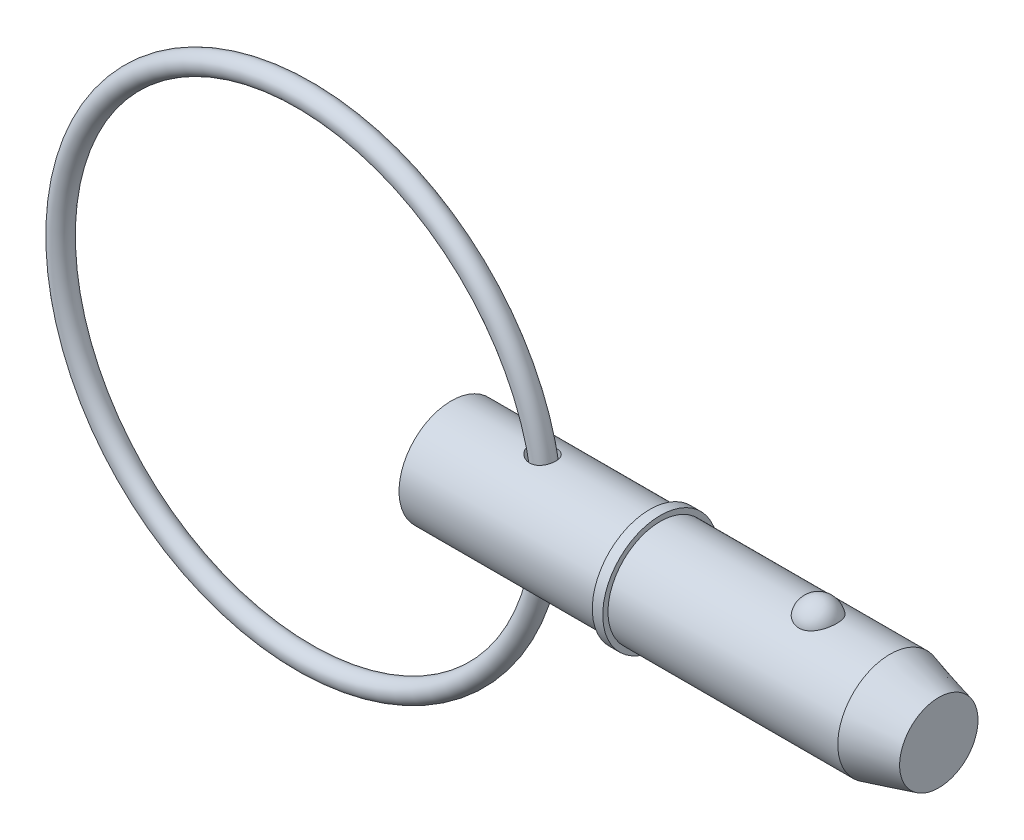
ISO-10303-21;
HEADER;
FILE_DESCRIPTION(('STEP AP214'),'2;1');
FILE_NAME('part.step','',(''),(''),'','','');
FILE_SCHEMA(('AUTOMOTIVE_DESIGN { 1 0 10303 214 1 1 1 1 }'));
ENDSEC;
DATA;
#1=APPLICATION_CONTEXT('core data for automotive mechanical design processes');
#2=APPLICATION_PROTOCOL_DEFINITION('international standard','automotive_design',2000,#1);
#3=PRODUCT_CONTEXT('',#1,'mechanical');
#4=PRODUCT('Part','Part','',(#3));
#5=PRODUCT_RELATED_PRODUCT_CATEGORY('part','',(#4));
#6=PRODUCT_DEFINITION_FORMATION('','',#4);
#7=PRODUCT_DEFINITION_CONTEXT('part definition',#1,'design');
#8=PRODUCT_DEFINITION('design','',#6,#7);
#9=PRODUCT_DEFINITION_SHAPE('','',#8);
#10=(LENGTH_UNIT() NAMED_UNIT(*) SI_UNIT(.MILLI.,.METRE.));
#11=(NAMED_UNIT(*) PLANE_ANGLE_UNIT() SI_UNIT($,.RADIAN.));
#12=(NAMED_UNIT(*) SI_UNIT($,.STERADIAN.) SOLID_ANGLE_UNIT());
#13=UNCERTAINTY_MEASURE_WITH_UNIT(LENGTH_MEASURE(1.E-05),#10,'distance_accuracy_value','');
#14=(GEOMETRIC_REPRESENTATION_CONTEXT(3) GLOBAL_UNCERTAINTY_ASSIGNED_CONTEXT((#13)) GLOBAL_UNIT_ASSIGNED_CONTEXT((#10,
#11,#12)) REPRESENTATION_CONTEXT('',''));
#15=CARTESIAN_POINT('',(0.,0.,0.));
#16=DIRECTION('',(0.,0.,1.));
#17=DIRECTION('',(1.,0.,0.));
#18=AXIS2_PLACEMENT_3D('',#15,#16,#17);
#19=CARTESIAN_POINT('',(-13.4013067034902,0.,0.));
#20=DIRECTION('',(0.,0.,1.));
#21=DIRECTION('',(1.,0.,0.));
#22=AXIS2_PLACEMENT_3D('',#19,#20,#21);
#23=TOROIDAL_SURFACE('',#22,22.225,0.952999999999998);
#24=CARTESIAN_POINT('',(9.77669329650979,0.,0.));
#25=VERTEX_POINT('',#24);
#26=VERTEX_LOOP('',#25);
#27=FACE_BOUND('',#26,.T.);
#28=ADVANCED_FACE('P0_F12',(#27),#23,.T.);
#29=CLOSED_SHELL('',(#28));
#30=MANIFOLD_SOLID_BREP('P0_B1',#29);
#31=CARTESIAN_POINT('',(0.,0.,0.));
#32=DIRECTION('',(1.,0.,0.));
#33=DIRECTION('',(0.,0.,-1.));
#34=AXIS2_PLACEMENT_3D('',#31,#32,#33);
#35=CYLINDRICAL_SURFACE('',#34,4.765);
#36=CARTESIAN_POINT('',(7.48459594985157,4.685973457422,-0.864220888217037));
#37=CARTESIAN_POINT('',(7.53849733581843,4.67711144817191,-0.912273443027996));
#38=CARTESIAN_POINT('',(7.59654891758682,4.66833039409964,-0.955745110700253));
#39=CARTESIAN_POINT('',(7.71924602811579,4.65195567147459,-1.03251233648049));
#40=CARTESIAN_POINT('',(7.78389917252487,4.64436340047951,-1.06579596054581));
#41=CARTESIAN_POINT('',(7.91808098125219,4.63129108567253,-1.12124172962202));
#42=CARTESIAN_POINT('',(7.98761280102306,4.62581242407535,-1.14339659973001));
#43=CARTESIAN_POINT('',(8.12956198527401,4.61771699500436,-1.17566870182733));
#44=CARTESIAN_POINT('',(8.20197774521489,4.61509865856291,-1.18579253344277));
#45=CARTESIAN_POINT('',(8.34550810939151,4.6131791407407,-1.19323853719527));
#46=CARTESIAN_POINT('',(8.41660306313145,4.61378793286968,-1.19090812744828));
#47=CARTESIAN_POINT('',(8.55721866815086,4.61812874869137,-1.17396277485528));
#48=CARTESIAN_POINT('',(8.62673979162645,4.62185982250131,-1.15935156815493));
#49=CARTESIAN_POINT('',(8.75801373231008,4.63172632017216,-1.11925454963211));
#50=CARTESIAN_POINT('',(8.81998342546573,4.63771186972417,-1.09443918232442));
#51=CARTESIAN_POINT('',(8.93863698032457,4.65140179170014,-1.03470792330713));
#52=CARTESIAN_POINT('',(8.99532131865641,4.65910600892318,-0.999792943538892));
#53=CARTESIAN_POINT('',(9.10080884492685,4.67519705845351,-0.921583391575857));
#54=CARTESIAN_POINT('',(9.14973848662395,4.68356861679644,-0.878455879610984));
#55=CARTESIAN_POINT('',(9.23971126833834,4.70019813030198,-0.784620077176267));
#56=CARTESIAN_POINT('',(9.28075401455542,4.7084560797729,-0.733911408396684));
#57=CARTESIAN_POINT('',(9.35441071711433,4.7240688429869,-0.62563775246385));
#58=CARTESIAN_POINT('',(9.38691359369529,4.73141115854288,-0.567995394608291));
#59=CARTESIAN_POINT('',(9.44203216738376,4.74427907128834,-0.447974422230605));
#60=CARTESIAN_POINT('',(9.46464743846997,4.74980459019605,-0.385595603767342));
#61=CARTESIAN_POINT('',(9.49961110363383,4.75848927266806,-0.257248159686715));
#62=CARTESIAN_POINT('',(9.51186382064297,4.76162635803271,-0.191251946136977));
#63=CARTESIAN_POINT('',(9.52545294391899,4.76511165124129,-0.0580729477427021));
#64=CARTESIAN_POINT('',(9.52678936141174,4.76545986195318,0.00910983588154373));
#65=CARTESIAN_POINT('',(9.51851557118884,4.76333054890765,0.142723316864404));
#66=CARTESIAN_POINT('',(9.50891008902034,4.76085424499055,0.209154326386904));
#67=CARTESIAN_POINT('',(9.47899306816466,4.75334441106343,0.339411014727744));
#68=CARTESIAN_POINT('',(9.45868126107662,4.74831081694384,0.403236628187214));
#69=CARTESIAN_POINT('',(9.4078294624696,4.73622777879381,0.526509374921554));
#70=CARTESIAN_POINT('',(9.37728413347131,4.72917728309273,0.585954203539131));
#71=CARTESIAN_POINT('',(9.30671117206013,4.71383320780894,0.698745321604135));
#72=CARTESIAN_POINT('',(9.26668347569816,4.70553961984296,0.752091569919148));
#73=CARTESIAN_POINT('',(9.17821531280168,4.68864637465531,0.851083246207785));
#74=CARTESIAN_POINT('',(9.12978756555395,4.68004719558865,0.896740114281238));
#75=CARTESIAN_POINT('',(9.02575872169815,4.66350833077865,0.97912505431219));
#76=CARTESIAN_POINT('',(8.97015856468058,4.65556855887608,1.01585429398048));
#77=CARTESIAN_POINT('',(8.85409306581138,4.6413534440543,1.0789347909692));
#78=CARTESIAN_POINT('',(8.79369898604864,4.63505812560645,1.10541268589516));
#79=CARTESIAN_POINT('',(8.66918290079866,4.62469916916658,1.1479836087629));
#80=CARTESIAN_POINT('',(8.60506121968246,4.62063533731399,1.1640775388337));
#81=CARTESIAN_POINT('',(8.47537782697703,4.61517348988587,1.18554696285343));
#82=CARTESIAN_POINT('',(8.4098281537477,4.61375835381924,1.19099130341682));
#83=CARTESIAN_POINT('',(8.2786938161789,4.61362908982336,1.19149080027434));
#84=CARTESIAN_POINT('',(8.21310914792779,4.61491539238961,1.18654430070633));
#85=CARTESIAN_POINT('',(8.08152457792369,4.62006017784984,1.16635311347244));
#86=CARTESIAN_POINT('',(8.01557748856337,4.62399895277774,1.15078675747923));
#87=CARTESIAN_POINT('',(7.88704537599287,4.63403793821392,1.10966738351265));
#88=CARTESIAN_POINT('',(7.82446148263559,4.64013886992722,1.08411103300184));
#89=CARTESIAN_POINT('',(7.70057947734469,4.65423592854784,1.02195168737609));
#90=CARTESIAN_POINT('',(7.63957197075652,4.66232221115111,0.984788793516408));
#91=CARTESIAN_POINT('',(7.52457021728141,4.67924552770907,0.900950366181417));
#92=CARTESIAN_POINT('',(7.47057819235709,4.68808279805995,0.854271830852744));
#93=CARTESIAN_POINT('',(7.37028930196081,4.70567913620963,0.751386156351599));
#94=CARTESIAN_POINT('',(7.32416327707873,4.7144333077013,0.695010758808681));
#95=CARTESIAN_POINT('',(7.24276674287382,4.73060166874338,0.574719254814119));
#96=CARTESIAN_POINT('',(7.20749051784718,4.73801656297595,0.510807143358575));
#97=CARTESIAN_POINT('',(7.15148495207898,4.75009927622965,0.381705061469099));
#98=CARTESIAN_POINT('',(7.12994463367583,4.7549169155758,0.31688231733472));
#99=CARTESIAN_POINT('',(7.09904467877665,4.76189692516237,0.184270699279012));
#100=CARTESIAN_POINT('',(7.08967554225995,4.76406136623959,0.116484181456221));
#101=CARTESIAN_POINT('',(7.08394150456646,4.76538257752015,-0.0133529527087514));
#102=CARTESIAN_POINT('',(7.0864533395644,4.76479916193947,-0.0753538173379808));
#103=CARTESIAN_POINT('',(7.10181380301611,4.76127985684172,-0.197993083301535));
#104=CARTESIAN_POINT('',(7.11466291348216,4.75834385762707,-0.258631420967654));
#105=CARTESIAN_POINT('',(7.14973937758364,4.75051877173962,-0.375744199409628));
#106=CARTESIAN_POINT('',(7.17178938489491,4.7456667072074,-0.432274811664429));
#107=CARTESIAN_POINT('',(7.22432962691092,4.73449674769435,-0.54107038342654));
#108=CARTESIAN_POINT('',(7.25481702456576,4.72817934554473,-0.593336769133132));
#109=CARTESIAN_POINT('',(7.31700895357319,4.71588241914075,-0.683642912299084));
#110=CARTESIAN_POINT('',(7.34750058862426,4.7100477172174,-0.722547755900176));
#111=CARTESIAN_POINT('',(7.41288050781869,4.69812059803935,-0.796421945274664));
#112=CARTESIAN_POINT('',(7.44776960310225,4.69202813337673,-0.831390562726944));
#113=CARTESIAN_POINT('',(7.48459594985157,4.685973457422,-0.864220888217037));
#114=B_SPLINE_CURVE_WITH_KNOTS('',3,(#36,#37,#38,#39,#40,#41,#42,#43,#44,#45,#46,#47,#48,#49,
#50,#51,#52,#53,#54,#55,#56,#57,#58,#59,#60,#61,#62,#63,#64,#65,#66,#67,#68,#69,#70,#71,#72,#73,
#74,#75,#76,#77,#78,#79,#80,#81,#82,#83,#84,#85,#86,#87,#88,#89,#90,#91,#92,#93,#94,#95,#96,#97,
#98,#99,#100,#101,#102,#103,#104,#105,#106,#107,#108,#109,#110,#111,#112,#113),.UNSPECIFIED.,
.T.,.F.,(4,2,2,2,2,2,2,2,2,2,2,2,2,2,2,2,2,2,2,2,2,2,2,2,2,2,2,2,2,2,2,2,2,2,2,2,2,2,4),(0.,
0.218078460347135,0.436411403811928,0.654886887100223,0.873242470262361,1.08553925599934,
1.2977714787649,1.49785367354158,1.6979178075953,1.8942789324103,2.09064985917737,
2.28946102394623,2.48828075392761,2.68891673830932,2.88955251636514,3.09010167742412,
3.29065586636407,3.49131482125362,3.69197512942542,3.89233421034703,4.09266707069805,
4.29043955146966,4.48819484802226,4.68466743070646,4.8811713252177,5.08390806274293,
5.28671248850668,5.50140943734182,5.71617422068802,5.93513249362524,6.15397522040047,
6.35827356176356,6.56241234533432,6.74765856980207,6.93291343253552,7.11475139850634,
7.29652829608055,7.44549570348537,7.59449062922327),.UNSPECIFIED.);
#115=CARTESIAN_POINT('',(7.48459594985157,4.685973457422,-0.864220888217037));
#116=VERTEX_POINT('',#115);
#117=EDGE_CURVE('P1_E42',#116,#116,#114,.T.);
#118=ORIENTED_EDGE('',*,*,#117,.T.);
#119=EDGE_LOOP('',(#118));
#120=FACE_BOUND('',#119,.T.);
#121=CARTESIAN_POINT('',(0.,0.,0.));
#122=DIRECTION('',(1.,0.,0.));
#123=DIRECTION('',(0.,0.,-1.));
#124=AXIS2_PLACEMENT_3D('',#121,#122,#123);
#125=CIRCLE('',#124,4.765);
#126=CARTESIAN_POINT('',(0.,0.,-4.765));
#127=VERTEX_POINT('',#126);
#128=EDGE_CURVE('P1_E9',#127,#127,#125,.T.);
#129=ORIENTED_EDGE('',*,*,#128,.T.);
#130=EDGE_LOOP('',(#129));
#131=FACE_BOUND('',#130,.T.);
#132=CARTESIAN_POINT('',(18.097,0.,0.));
#133=DIRECTION('',(1.,0.,0.));
#134=DIRECTION('',(0.,0.,-1.));
#135=AXIS2_PLACEMENT_3D('',#132,#133,#134);
#136=CIRCLE('',#135,4.765);
#137=CARTESIAN_POINT('',(18.097,0.,-4.765));
#138=VERTEX_POINT('',#137);
#139=EDGE_CURVE('P1_E25',#138,#138,#136,.T.);
#140=ORIENTED_EDGE('',*,*,#139,.F.);
#141=EDGE_LOOP('',(#140));
#142=FACE_BOUND('',#141,.T.);
#143=CARTESIAN_POINT('',(7.48459594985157,-4.685973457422,-0.864220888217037));
#144=CARTESIAN_POINT('',(7.43440944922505,-4.6942250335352,-0.819477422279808));
#145=CARTESIAN_POINT('',(7.38778663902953,-4.70255210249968,-0.77073361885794));
#146=CARTESIAN_POINT('',(7.3030968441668,-4.7184989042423,-0.666172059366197));
#147=CARTESIAN_POINT('',(7.26503010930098,-4.72611861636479,-0.610354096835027));
#148=CARTESIAN_POINT('',(7.19878266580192,-4.73983819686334,-0.492624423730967));
#149=CARTESIAN_POINT('',(7.17064194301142,-4.74593188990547,-0.430689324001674));
#150=CARTESIAN_POINT('',(7.12584349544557,-4.75581281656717,-0.3026233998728));
#151=CARTESIAN_POINT('',(7.10917889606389,-4.75960143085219,-0.236495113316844));
#152=CARTESIAN_POINT('',(7.0889853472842,-4.76421379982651,-0.106818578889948));
#153=CARTESIAN_POINT('',(7.0846333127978,-4.76522320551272,-0.0434047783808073));
#154=CARTESIAN_POINT('',(7.08693064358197,-4.7646936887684,0.0832041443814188));
#155=CARTESIAN_POINT('',(7.09357756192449,-4.76315533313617,0.146399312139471));
#156=CARTESIAN_POINT('',(7.11694629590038,-4.75784365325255,0.267709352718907));
#157=CARTESIAN_POINT('',(7.13318365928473,-4.75417793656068,0.325923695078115));
#158=CARTESIAN_POINT('',(7.17459606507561,-4.74508048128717,0.438922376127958));
#159=CARTESIAN_POINT('',(7.19977257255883,-4.73964845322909,0.493706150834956));
#160=CARTESIAN_POINT('',(7.25946789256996,-4.72725615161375,0.60111049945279));
#161=CARTESIAN_POINT('',(7.2943661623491,-4.72023663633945,0.653512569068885));
#162=CARTESIAN_POINT('',(7.37173226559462,-4.70550732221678,0.752279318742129));
#163=CARTESIAN_POINT('',(7.41420315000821,-4.69779724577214,0.798641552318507));
#164=CARTESIAN_POINT('',(7.50982312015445,-4.6816641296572,0.888551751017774));
#165=CARTESIAN_POINT('',(7.56359853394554,-4.67324162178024,0.931434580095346));
#166=CARTESIAN_POINT('',(7.67736628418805,-4.65728554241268,1.00819498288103));
#167=CARTESIAN_POINT('',(7.7373611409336,-4.64975233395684,1.04206888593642));
#168=CARTESIAN_POINT('',(7.86574076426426,-4.63599923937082,1.10169445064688));
#169=CARTESIAN_POINT('',(7.93441048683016,-4.62988111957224,1.12685968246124));
#170=CARTESIAN_POINT('',(8.07519000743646,-4.62035710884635,1.16529928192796));
#171=CARTESIAN_POINT('',(8.14729925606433,-4.61695078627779,1.1785755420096));
#172=CARTESIAN_POINT('',(8.29111621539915,-4.61341807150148,1.19232949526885));
#173=CARTESIAN_POINT('',(8.36279361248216,-4.61321655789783,1.19310032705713));
#174=CARTESIAN_POINT('',(8.50512944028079,-4.61602317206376,1.1821962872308));
#175=CARTESIAN_POINT('',(8.57578827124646,-4.61903000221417,1.17052644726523));
#176=CARTESIAN_POINT('',(8.70965757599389,-4.62766311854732,1.13589249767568));
#177=CARTESIAN_POINT('',(8.77306169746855,-4.63312492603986,1.11363308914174));
#178=CARTESIAN_POINT('',(8.8949702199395,-4.64598463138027,1.05869880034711));
#179=CARTESIAN_POINT('',(8.95347516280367,-4.65338231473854,1.02602507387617));
#180=CARTESIAN_POINT('',(9.06253415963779,-4.66906009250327,0.952097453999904));
#181=CARTESIAN_POINT('',(9.11324728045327,-4.67731427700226,0.911072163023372));
#182=CARTESIAN_POINT('',(9.20707850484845,-4.69393979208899,0.821122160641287));
#183=CARTESIAN_POINT('',(9.25019629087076,-4.70231112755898,0.772197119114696));
#184=CARTESIAN_POINT('',(9.32819072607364,-4.71835356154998,0.667239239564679));
#185=CARTESIAN_POINT('',(9.36297449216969,-4.72601623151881,0.611136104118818));
#186=CARTESIAN_POINT('',(9.42286382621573,-4.73971239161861,0.493799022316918));
#187=CARTESIAN_POINT('',(9.44796891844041,-4.74574580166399,0.432564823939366));
#188=CARTESIAN_POINT('',(9.48811605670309,-4.75559286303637,0.305990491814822));
#189=CARTESIAN_POINT('',(9.50304870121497,-4.75938232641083,0.240613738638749));
#190=CARTESIAN_POINT('',(9.5220569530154,-4.76423188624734,0.108201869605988));
#191=CARTESIAN_POINT('',(9.52613255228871,-4.76529198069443,0.0411667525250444));
#192=CARTESIAN_POINT('',(9.52332772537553,-4.76456884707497,-0.0926701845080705));
#193=CARTESIAN_POINT('',(9.51644541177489,-4.76278512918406,-0.159471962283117));
#194=CARTESIAN_POINT('',(9.49188827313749,-4.75656536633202,-0.290934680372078));
#195=CARTESIAN_POINT('',(9.47421322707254,-4.75212926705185,-0.355595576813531));
#196=CARTESIAN_POINT('',(9.42849503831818,-4.74108318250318,-0.480955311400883));
#197=CARTESIAN_POINT('',(9.4004503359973,-4.73447287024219,-0.541653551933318));
#198=CARTESIAN_POINT('',(9.33467290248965,-4.71979928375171,-0.657361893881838));
#199=CARTESIAN_POINT('',(9.29694000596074,-4.71173598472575,-0.712371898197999));
#200=CARTESIAN_POINT('',(9.2127449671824,-4.69505469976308,-0.815106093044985));
#201=CARTESIAN_POINT('',(9.1662875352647,-4.68643701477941,-0.862834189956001));
#202=CARTESIAN_POINT('',(9.06584125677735,-4.66961864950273,-0.949656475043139));
#203=CARTESIAN_POINT('',(9.01185326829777,-4.66141792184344,-0.98875164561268));
#204=CARTESIAN_POINT('',(8.8985010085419,-4.64646376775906,-1.0567894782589));
#205=CARTESIAN_POINT('',(8.83920621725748,-4.63969468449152,-1.08584444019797));
#206=CARTESIAN_POINT('',(8.71642097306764,-4.62824519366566,-1.13365785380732));
#207=CARTESIAN_POINT('',(8.65293102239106,-4.623564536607,-1.15241753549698));
#208=CARTESIAN_POINT('',(8.52421291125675,-4.61681938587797,-1.17914952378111));
#209=CARTESIAN_POINT('',(8.45900634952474,-4.6147310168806,-1.18722032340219));
#210=CARTESIAN_POINT('',(8.32811210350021,-4.61325848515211,-1.19292878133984));
#211=CARTESIAN_POINT('',(8.26242433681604,-4.61387479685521,-1.19056460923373));
#212=CARTESIAN_POINT('',(8.13057358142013,-4.6177227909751,-1.17555160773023));
#213=CARTESIAN_POINT('',(8.06444352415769,-4.62102282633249,-1.16263394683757));
#214=CARTESIAN_POINT('',(7.93513143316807,-4.62989870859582,-1.12676570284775));
#215=CARTESIAN_POINT('',(7.87194976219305,-4.6354748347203,-1.10381388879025));
#216=CARTESIAN_POINT('',(7.75155849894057,-4.64811746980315,-1.04928030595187));
#217=CARTESIAN_POINT('',(7.69423767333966,-4.65514232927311,-1.01793362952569));
#218=CARTESIAN_POINT('',(7.58503138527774,-4.67007903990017,-0.947046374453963));
#219=CARTESIAN_POINT('',(7.53314612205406,-4.67799092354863,-0.907505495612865));
#220=CARTESIAN_POINT('',(7.48459594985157,-4.685973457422,-0.864220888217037));
#221=B_SPLINE_CURVE_WITH_KNOTS('',3,(#143,#144,#145,#146,#147,#148,#149,#150,#151,#152,#153,
#154,#155,#156,#157,#158,#159,#160,#161,#162,#163,#164,#165,#166,#167,#168,#169,#170,#171,#172,
#173,#174,#175,#176,#177,#178,#179,#180,#181,#182,#183,#184,#185,#186,#187,#188,#189,#190,#191,
#192,#193,#194,#195,#196,#197,#198,#199,#200,#201,#202,#203,#204,#205,#206,#207,#208,#209,#210,
#211,#212,#213,#214,#215,#216,#217,#218,#219,#220),.UNSPECIFIED.,.T.,.F.,(4,2,2,2,2,2,2,2,2,2,2,
2,2,2,2,2,2,2,2,2,2,2,2,2,2,2,2,2,2,2,2,2,2,2,2,2,2,2,4),(0.,0.203013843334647,
0.406033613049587,0.609862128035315,0.813568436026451,1.0032929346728,1.19297523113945,
1.37380897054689,1.55467236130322,1.74393241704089,1.93326889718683,2.14025373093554,
2.3473227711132,2.566425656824,2.78549366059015,2.9994188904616,3.21325763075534,
3.41451842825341,3.61575693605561,3.81208930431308,4.00842987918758,4.20686629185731,
4.40531245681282,4.60586051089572,4.80640871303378,5.0069914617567,5.20757831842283,
5.40819535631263,5.60881581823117,5.80932827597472,6.00981790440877,6.2079863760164,
6.40613116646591,6.60243714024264,6.79877754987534,7.00028133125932,7.20180983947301,
7.39819723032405,7.59459181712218),.UNSPECIFIED.);
#222=CARTESIAN_POINT('',(7.48459594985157,-4.685973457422,-0.864220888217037));
#223=VERTEX_POINT('',#222);
#224=EDGE_CURVE('P1_E17',#223,#223,#221,.T.);
#225=ORIENTED_EDGE('',*,*,#224,.T.);
#226=EDGE_LOOP('',(#225));
#227=FACE_BOUND('',#226,.T.);
#228=ADVANCED_FACE('P1_F13',(#120,#131,#142,#227),#35,.T.);
#229=CARTESIAN_POINT('',(0.,0.,0.));
#230=DIRECTION('',(1.,0.,0.));
#231=DIRECTION('',(0.,0.,-1.));
#232=AXIS2_PLACEMENT_3D('',#229,#230,#231);
#233=CYLINDRICAL_SURFACE('',#232,4.765);
#234=CARTESIAN_POINT('',(40.0041944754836,0.,0.));
#235=DIRECTION('',(1.,0.,0.));
#236=DIRECTION('',(0.,0.,-1.));
#237=AXIS2_PLACEMENT_3D('',#234,#235,#236);
#238=CIRCLE('',#237,4.765);
#239=CARTESIAN_POINT('',(40.0041944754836,0.,-4.765));
#240=VERTEX_POINT('',#239);
#241=EDGE_CURVE('P1_E99',#240,#240,#238,.T.);
#242=ORIENTED_EDGE('',*,*,#241,.F.);
#243=EDGE_LOOP('',(#242));
#244=FACE_BOUND('',#243,.T.);
#245=CARTESIAN_POINT('',(19.05,0.,0.));
#246=DIRECTION('',(1.,0.,0.));
#247=DIRECTION('',(0.,0.,-1.));
#248=AXIS2_PLACEMENT_3D('',#245,#246,#247);
#249=CIRCLE('',#248,4.765);
#250=CARTESIAN_POINT('',(19.05,0.,-4.765));
#251=VERTEX_POINT('',#250);
#252=EDGE_CURVE('P1_E96',#251,#251,#249,.T.);
#253=ORIENTED_EDGE('',*,*,#252,.T.);
#254=EDGE_LOOP('',(#253));
#255=FACE_BOUND('',#254,.T.);
#256=CARTESIAN_POINT('',(33.451020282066,4.42764777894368,1.76101111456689));
#257=CARTESIAN_POINT('',(33.3597212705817,4.42764470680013,1.76101422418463));
#258=CARTESIAN_POINT('',(33.2684468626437,4.43059091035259,1.75366340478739));
#259=CARTESIAN_POINT('',(33.0886154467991,4.44201846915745,1.72451180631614));
#260=CARTESIAN_POINT('',(33.0000577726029,4.45049845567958,1.70271460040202));
#261=CARTESIAN_POINT('',(32.8282570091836,4.47200516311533,1.64539370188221));
#262=CARTESIAN_POINT('',(32.7450064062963,4.48502527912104,1.60988994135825));
#263=CARTESIAN_POINT('',(32.5857633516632,4.51419542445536,1.52617873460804));
#264=CARTESIAN_POINT('',(32.5097723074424,4.53034605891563,1.47796883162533));
#265=CARTESIAN_POINT('',(32.3647445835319,4.56459317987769,1.36860494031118));
#266=CARTESIAN_POINT('',(32.2959645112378,4.58273170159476,1.30712420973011));
#267=CARTESIAN_POINT('',(32.1693423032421,4.61870302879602,1.17370204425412));
#268=CARTESIAN_POINT('',(32.1115021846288,4.63653577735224,1.10175868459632));
#269=CARTESIAN_POINT('',(32.0055709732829,4.67090140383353,0.94580676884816));
#270=CARTESIAN_POINT('',(31.9580305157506,4.68734068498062,0.861402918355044));
#271=CARTESIAN_POINT('',(31.8770817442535,4.71628466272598,0.685442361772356));
#272=CARTESIAN_POINT('',(31.8436747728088,4.72878898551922,0.593884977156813));
#273=CARTESIAN_POINT('',(31.791287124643,4.74874061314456,0.404781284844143));
#274=CARTESIAN_POINT('',(31.7725178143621,4.75611366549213,0.307168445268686));
#275=CARTESIAN_POINT('',(31.7505846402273,4.76475393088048,0.109940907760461));
#276=CARTESIAN_POINT('',(31.7474205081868,4.76602124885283,0.0103262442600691));
#277=CARTESIAN_POINT('',(31.7567405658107,4.76232928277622,-0.187629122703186));
#278=CARTESIAN_POINT('',(31.7691588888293,4.7573962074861,-0.28597342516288));
#279=CARTESIAN_POINT('',(31.8092804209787,4.74184975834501,-0.479027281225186));
#280=CARTESIAN_POINT('',(31.8369839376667,4.7312362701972,-0.573736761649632));
#281=CARTESIAN_POINT('',(31.9071581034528,4.70540026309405,-0.756973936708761));
#282=CARTESIAN_POINT('',(31.9496460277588,4.69017235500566,-0.84549425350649));
#283=CARTESIAN_POINT('',(32.048520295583,4.6566986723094,-1.01378033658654));
#284=CARTESIAN_POINT('',(32.1049076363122,4.63845268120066,-1.09354547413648));
#285=CARTESIAN_POINT('',(32.230552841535,4.60085438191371,-1.24228523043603));
#286=CARTESIAN_POINT('',(32.2998439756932,4.58149930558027,-1.31123108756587));
#287=CARTESIAN_POINT('',(32.4496066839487,4.54391653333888,-1.43607409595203));
#288=CARTESIAN_POINT('',(32.5300771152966,4.52568872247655,-1.49197257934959));
#289=CARTESIAN_POINT('',(32.6981500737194,4.49293007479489,-1.58786764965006));
#290=CARTESIAN_POINT('',(32.7855445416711,4.47832346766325,-1.62820219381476));
#291=CARTESIAN_POINT('',(32.966553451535,4.45406011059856,-1.69345757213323));
#292=CARTESIAN_POINT('',(33.0601655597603,4.44440151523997,-1.71838415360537));
#293=CARTESIAN_POINT('',(33.2458939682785,4.43159888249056,-1.75112843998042));
#294=CARTESIAN_POINT('',(33.337849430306,4.42815213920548,-1.75974223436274));
#295=CARTESIAN_POINT('',(33.5219658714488,4.427247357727,-1.76201865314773));
#296=CARTESIAN_POINT('',(33.6141268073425,4.42978816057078,-1.7556841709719));
#297=CARTESIAN_POINT('',(33.7931292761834,4.44038648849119,-1.72869560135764));
#298=CARTESIAN_POINT('',(33.8800474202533,4.44827555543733,-1.70847853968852));
#299=CARTESIAN_POINT('',(34.0491314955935,4.46852246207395,-1.65479562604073));
#300=CARTESIAN_POINT('',(34.1312970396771,4.48088066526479,-1.62132869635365));
#301=CARTESIAN_POINT('',(34.2905916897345,4.50907357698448,-1.54120560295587));
#302=CARTESIAN_POINT('',(34.3675700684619,4.52497884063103,-1.49427526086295));
#303=CARTESIAN_POINT('',(34.5127080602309,4.55845148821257,-1.38881222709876));
#304=CARTESIAN_POINT('',(34.5808656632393,4.57601924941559,-1.3302768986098));
#305=CARTESIAN_POINT('',(34.7100990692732,4.61196537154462,-1.1999104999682));
#306=CARTESIAN_POINT('',(34.7706562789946,4.63034074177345,-1.12756415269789));
#307=CARTESIAN_POINT('',(34.8792797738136,4.66513959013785,-0.973612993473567));
#308=CARTESIAN_POINT('',(34.9273438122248,4.68156271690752,-0.892006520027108));
#309=CARTESIAN_POINT('',(35.011383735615,4.71130224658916,-0.718892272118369));
#310=CARTESIAN_POINT('',(35.0469185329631,4.724501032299,-0.62714967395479));
#311=CARTESIAN_POINT('',(35.1029522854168,4.74571823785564,-0.438611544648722));
#312=CARTESIAN_POINT('',(35.123450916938,4.75373654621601,-0.341815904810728));
#313=CARTESIAN_POINT('',(35.1490338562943,4.76378905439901,-0.145633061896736));
#314=CARTESIAN_POINT('',(35.154076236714,4.76580697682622,-0.0462395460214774));
#315=CARTESIAN_POINT('',(35.1485239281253,4.7636057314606,0.152038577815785));
#316=CARTESIAN_POINT('',(35.1379294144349,4.75938663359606,0.250923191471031));
#317=CARTESIAN_POINT('',(35.1013875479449,4.74516937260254,0.445004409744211));
#318=CARTESIAN_POINT('',(35.0754964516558,4.73519238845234,0.540213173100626));
#319=CARTESIAN_POINT('',(35.0089273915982,4.7104939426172,0.724662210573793));
#320=CARTESIAN_POINT('',(34.968248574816,4.69577220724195,0.813902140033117));
#321=CARTESIAN_POINT('',(34.8727177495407,4.66303767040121,0.984313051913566));
#322=CARTESIAN_POINT('',(34.8178042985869,4.64501070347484,1.06544688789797));
#323=CARTESIAN_POINT('',(34.6950496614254,4.60764678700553,1.21692673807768));
#324=CARTESIAN_POINT('',(34.6272086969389,4.58830985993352,1.2872729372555));
#325=CARTESIAN_POINT('',(34.4805480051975,4.55060370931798,1.41479271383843));
#326=CARTESIAN_POINT('',(34.4017918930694,4.53222967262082,1.47203785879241));
#327=CARTESIAN_POINT('',(34.2349890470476,4.49849576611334,1.57212016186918));
#328=CARTESIAN_POINT('',(34.1469417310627,4.48313608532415,1.61495641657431));
#329=CARTESIAN_POINT('',(33.9597918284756,4.45676184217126,1.68642657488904));
#330=CARTESIAN_POINT('',(33.8603653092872,4.44598302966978,1.71430590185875));
#331=CARTESIAN_POINT('',(33.6576210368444,4.43142918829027,1.75159258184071));
#332=CARTESIAN_POINT('',(33.5543049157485,4.42765125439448,1.76100759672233));
#333=CARTESIAN_POINT('',(33.451020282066,4.42764777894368,1.76101111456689));
#334=B_SPLINE_CURVE_WITH_KNOTS('',3,(#256,#257,#258,#259,#260,#261,#262,#263,#264,#265,#266,
#267,#268,#269,#270,#271,#272,#273,#274,#275,#276,#277,#278,#279,#280,#281,#282,#283,#284,#285,
#286,#287,#288,#289,#290,#291,#292,#293,#294,#295,#296,#297,#298,#299,#300,#301,#302,#303,#304,
#305,#306,#307,#308,#309,#310,#311,#312,#313,#314,#315,#316,#317,#318,#319,#320,#321,#322,#323,
#324,#325,#326,#327,#328,#329,#330,#331,#332,#333),.UNSPECIFIED.,.T.,.F.,(4,2,2,2,2,2,2,2,2,2,2,
2,2,2,2,2,2,2,2,2,2,2,2,2,2,2,2,2,2,2,2,2,2,2,2,2,2,2,4),(0.,0.273517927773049,
0.546968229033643,0.820022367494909,1.09312934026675,1.37393946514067,1.65480131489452,
1.94820420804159,2.24163496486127,2.53922817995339,2.83681628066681,3.1331507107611,
3.42949110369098,3.72617893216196,4.02288805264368,4.32037303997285,4.61782764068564,
4.9084009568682,5.1988658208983,5.47474855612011,5.75057789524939,6.01809977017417,
6.2856434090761,6.55907787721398,6.83257454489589,7.11962987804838,7.40673679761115,
7.70312663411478,7.99952284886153,8.29672237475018,8.59391856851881,8.8900285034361,
9.18615552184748,9.48358266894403,9.78100471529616,10.0767610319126,10.3725358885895,
10.6820893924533,10.9915144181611),.UNSPECIFIED.);
#335=CARTESIAN_POINT('',(33.451020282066,4.42764777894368,1.76101111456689));
#336=VERTEX_POINT('',#335);
#337=EDGE_CURVE('P1_E34',#336,#336,#334,.T.);
#338=ORIENTED_EDGE('',*,*,#337,.T.);
#339=EDGE_LOOP('',(#338));
#340=FACE_BOUND('',#339,.T.);
#341=ADVANCED_FACE('P1_F46',(#244,#255,#340),#233,.T.);
#342=CARTESIAN_POINT('',(0.,0.,0.));
#343=DIRECTION('',(-1.,0.,0.));
#344=DIRECTION('',(0.,0.,1.));
#345=AXIS2_PLACEMENT_3D('',#342,#343,#344);
#346=PLANE('',#345);
#347=ORIENTED_EDGE('',*,*,#128,.F.);
#348=EDGE_LOOP('',(#347));
#349=FACE_BOUND('',#348,.T.);
#350=ADVANCED_FACE('P1_F15',(#349),#346,.T.);
#351=CARTESIAN_POINT('',(18.097,4.765,0.));
#352=DIRECTION('',(-1.,0.,0.));
#353=DIRECTION('',(0.,0.,1.));
#354=AXIS2_PLACEMENT_3D('',#351,#352,#353);
#355=PLANE('',#354);
#356=ORIENTED_EDGE('',*,*,#139,.T.);
#357=EDGE_LOOP('',(#356));
#358=FACE_BOUND('',#357,.T.);
#359=CARTESIAN_POINT('',(18.097,0.,0.));
#360=DIRECTION('',(1.,0.,0.));
#361=DIRECTION('',(0.,0.,-1.));
#362=AXIS2_PLACEMENT_3D('',#359,#360,#361);
#363=CIRCLE('',#362,5.2415);
#364=CARTESIAN_POINT('',(18.097,0.,-5.2415));
#365=VERTEX_POINT('',#364);
#366=EDGE_CURVE('P1_E30',#365,#365,#363,.T.);
#367=ORIENTED_EDGE('',*,*,#366,.F.);
#368=EDGE_LOOP('',(#367));
#369=FACE_BOUND('',#368,.T.);
#370=ADVANCED_FACE('P1_F81',(#358,#369),#355,.T.);
#371=CARTESIAN_POINT('',(0.,0.,0.));
#372=DIRECTION('',(1.,0.,0.));
#373=DIRECTION('',(0.,0.,-1.));
#374=AXIS2_PLACEMENT_3D('',#371,#372,#373);
#375=CYLINDRICAL_SURFACE('',#374,5.2415);
#376=ORIENTED_EDGE('',*,*,#366,.T.);
#377=EDGE_LOOP('',(#376));
#378=FACE_BOUND('',#377,.T.);
#379=CARTESIAN_POINT('',(19.05,0.,0.));
#380=DIRECTION('',(1.,0.,0.));
#381=DIRECTION('',(0.,0.,-1.));
#382=AXIS2_PLACEMENT_3D('',#379,#380,#381);
#383=CIRCLE('',#382,5.2415);
#384=CARTESIAN_POINT('',(19.05,0.,-5.2415));
#385=VERTEX_POINT('',#384);
#386=EDGE_CURVE('P1_E95',#385,#385,#383,.T.);
#387=ORIENTED_EDGE('',*,*,#386,.F.);
#388=EDGE_LOOP('',(#387));
#389=FACE_BOUND('',#388,.T.);
#390=ADVANCED_FACE('P1_F68',(#378,#389),#375,.T.);
#391=CARTESIAN_POINT('',(19.05,5.2415,0.));
#392=DIRECTION('',(1.,0.,0.));
#393=DIRECTION('',(0.,0.,-1.));
#394=AXIS2_PLACEMENT_3D('',#391,#392,#393);
#395=PLANE('',#394);
#396=ORIENTED_EDGE('',*,*,#386,.T.);
#397=EDGE_LOOP('',(#396));
#398=FACE_BOUND('',#397,.T.);
#399=ORIENTED_EDGE('',*,*,#252,.F.);
#400=EDGE_LOOP('',(#399));
#401=FACE_BOUND('',#400,.T.);
#402=ADVANCED_FACE('P1_F62',(#398,#401),#395,.T.);
#403=CARTESIAN_POINT('',(44.45,0.,0.));
#404=DIRECTION('',(-1.,0.,0.));
#405=DIRECTION('',(0.,0.,1.));
#406=AXIS2_PLACEMENT_3D('',#403,#404,#405);
#407=CONICAL_SURFACE('',#406,3.57375000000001,0.26179938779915);
#408=ORIENTED_EDGE('',*,*,#241,.T.);
#409=EDGE_LOOP('',(#408));
#410=FACE_BOUND('',#409,.T.);
#411=CARTESIAN_POINT('',(44.45,0.,0.));
#412=DIRECTION('',(1.,0.,0.));
#413=DIRECTION('',(0.,0.,-1.));
#414=AXIS2_PLACEMENT_3D('',#411,#412,#413);
#415=CIRCLE('',#414,3.57375000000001);
#416=CARTESIAN_POINT('',(44.45,0.,-3.57375000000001));
#417=VERTEX_POINT('',#416);
#418=EDGE_CURVE('P1_E41',#417,#417,#415,.T.);
#419=ORIENTED_EDGE('',*,*,#418,.F.);
#420=EDGE_LOOP('',(#419));
#421=FACE_BOUND('',#420,.T.);
#422=ADVANCED_FACE('P1_F59',(#410,#421),#407,.T.);
#423=CARTESIAN_POINT('',(44.45,3.57375000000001,0.));
#424=DIRECTION('',(1.,0.,0.));
#425=DIRECTION('',(0.,0.,-1.));
#426=AXIS2_PLACEMENT_3D('',#423,#424,#425);
#427=PLANE('',#426);
#428=ORIENTED_EDGE('',*,*,#418,.T.);
#429=EDGE_LOOP('',(#428));
#430=FACE_BOUND('',#429,.T.);
#431=ADVANCED_FACE('P1_F55',(#430),#427,.T.);
#432=CARTESIAN_POINT('',(33.451020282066,4.28849999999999,0.));
#433=DIRECTION('',(-1.,0.,0.));
#434=DIRECTION('',(0.,1.,0.));
#435=AXIS2_PLACEMENT_3D('',#432,#433,#434);
#436=SPHERICAL_SURFACE('',#435,1.76650000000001);
#437=ORIENTED_EDGE('',*,*,#337,.F.);
#438=EDGE_LOOP('',(#437));
#439=FACE_BOUND('',#438,.T.);
#440=ADVANCED_FACE('P1_F50',(#439),#436,.T.);
#441=CARTESIAN_POINT('',(-13.4013067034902,0.,0.));
#442=DIRECTION('',(0.,0.,1.));
#443=DIRECTION('',(1.,0.,0.));
#444=AXIS2_PLACEMENT_3D('',#441,#442,#443);
#445=TOROIDAL_SURFACE('',#444,22.225,1.19125);
#446=ORIENTED_EDGE('',*,*,#224,.F.);
#447=EDGE_LOOP('',(#446));
#448=FACE_BOUND('',#447,.T.);
#449=ORIENTED_EDGE('',*,*,#117,.F.);
#450=EDGE_LOOP('',(#449));
#451=FACE_BOUND('',#450,.T.);
#452=ADVANCED_FACE('P1_F54',(#448,#451),#445,.F.);
#453=CLOSED_SHELL('',(#228,#341,#350,#370,#390,#402,#422,#431,#440,#452));
#454=MANIFOLD_SOLID_BREP('P1_B1',#453);
#455=ADVANCED_BREP_SHAPE_REPRESENTATION('',(#18,#30,#454),#14);
#456=SHAPE_DEFINITION_REPRESENTATION(#9,#455);
ENDSEC;
END-ISO-10303-21;
